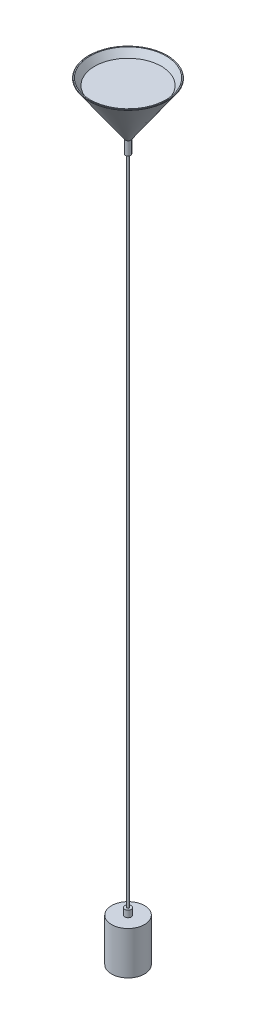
from build123d import *

# Parameters (mm, degrees)
VACIADO1_T              = -2
REDONDEO2_R             = 0.5
CROQUIS7_R              = 4
SALIENTE_EXTRUIR1_DEPTH = 20
CROQUIS8_R              = 1.5
SALIENTE_EXTRUIR2_DEPTH = 1000
CROQUIS9_R              = 25
SALIENTE_EXTRUIR3_DEPTH = 65
CROQUIS10_R             = 5
SALIENTE_EXTRUIR4_DEPTH = 10


with BuildPart() as part:
    # Croquis1 → Revoluci_n1 (revolve)
    with BuildSketch(Plane.XY, mode=Mode.PRIVATE) as revoluci_n1_sk:
        Polygon((-60, 80), (0, 80), (0, 0), (-4, 0), align=None)
    revolve(revoluci_n1_sk.sketch.rotate(Axis((0, 0, 0), (0, 1, 0)), 90), axis=Axis((0, 0, 0), (0, 1, 0)))

    # Vaciado1
    vaciado1_openings = [part.faces().sort_by_distance(p)[0] for p in [
        (0, 80, 0),
    ]]
    offset(amount=VACIADO1_T, openings=vaciado1_openings, kind=Kind.INTERSECTION)

    # Redondeo2
    redondeo2_edges = [part.edges().sort_by_distance(p)[0] for p in [
        (0, 80, -60),
    ]]
    fillet(redondeo2_edges, radius=REDONDEO2_R)


with BuildPart() as body_2:
    # Croquis5 → Revoluci_n2 (revolve)
    with BuildSketch(Plane.XY):
        Polygon((50.811094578, 70), (50.373594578, 69.5), (0, 69.5), (0, 70), align=None)
    revolve(axis=Axis((0, 0, 0), (0, 1, 0)))


with BuildPart() as body_3:
    # Croquis7 → Saliente-Extruir1 (new body)
    with BuildSketch(Plane.XZ):
        with Locations(Location((0, 0, 0), (0, 0, 270))):
            Circle(CROQUIS7_R)
    extrude(amount=SALIENTE_EXTRUIR1_DEPTH)


with BuildPart() as body_4:
    # Croquis8 → Saliente-Extruir2 (new body)
    with BuildSketch(Plane.XZ.offset(20)):
        with Locations(Location((0, 0, 0), (0, 0, 270))):
            Circle(CROQUIS8_R)
    extrude(amount=SALIENTE_EXTRUIR2_DEPTH)


with BuildPart() as body_5:
    # Croquis9 → Saliente-Extruir3 (new body)
    with BuildSketch(Plane.XZ.offset(1020)):
        with Locations(Location((0, 0, 0), (0, 0, 270))):
            Circle(CROQUIS9_R)
    extrude(amount=SALIENTE_EXTRUIR3_DEPTH)


with BuildPart() as body_6:
    # Croquis10 → Saliente-Extruir4 (new body)
    with BuildSketch(Plane(origin=(0, -1020, 0), x_dir=(1, 0, 0), z_dir=(0, 1, 0))):
        with Locations(Location((0, 0, 0), (0, 0, 270))):
            Circle(CROQUIS10_R)
    extrude(amount=SALIENTE_EXTRUIR4_DEPTH)


solid = Compound([part.part, body_2.part, body_3.part, body_4.part, body_5.part, body_6.part])
